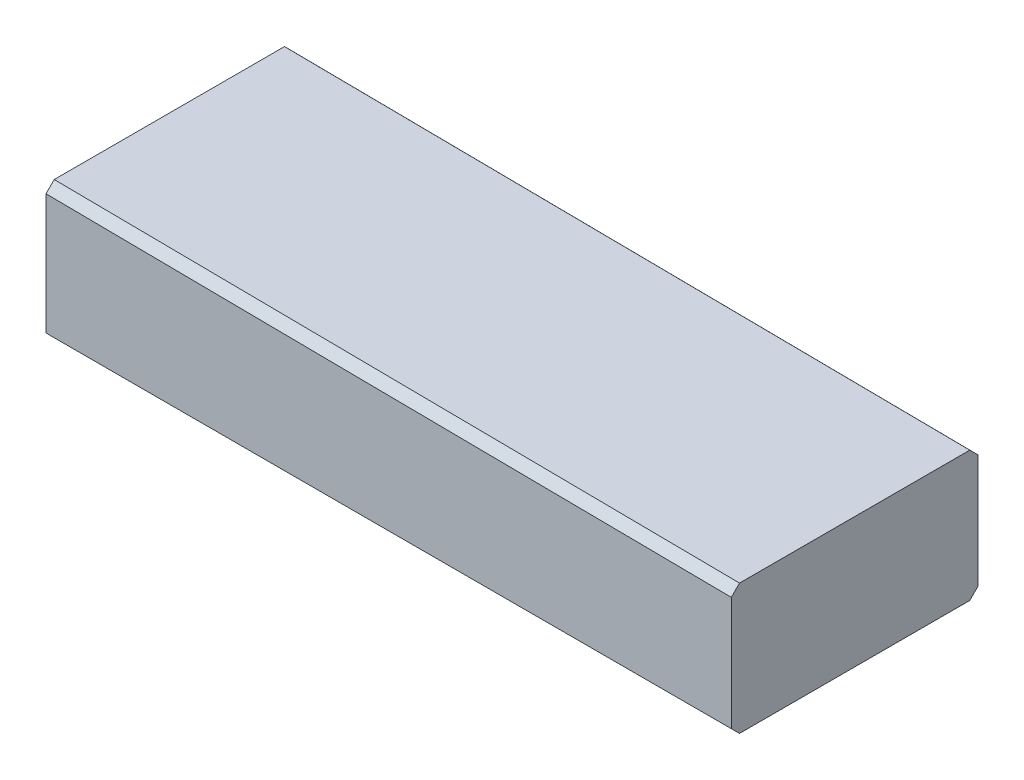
from build123d import *

# Parameters (mm, degrees)
BASEBODY_DEPTH = 36
CHAMFER1_SIZE  = 1.2


with BuildPart() as part:
    # BodySke → BaseBody (new body)
    with BuildSketch(Plane.XY):
        Polygon((0, 0), (0, 20), (100, 19), (100, 0), align=None)
    extrude(amount=BASEBODY_DEPTH)

    # Chamfer1
    chamfer1_edges = [part.edges().sort_by_distance(p)[0] for p in [
        (50, 19.5, 36),
        (50, 0, 36),
        (50, 19.5, 0),
        (50, 0, 0),
    ]]
    chamfer(chamfer1_edges, length=CHAMFER1_SIZE)


solid = part.part
